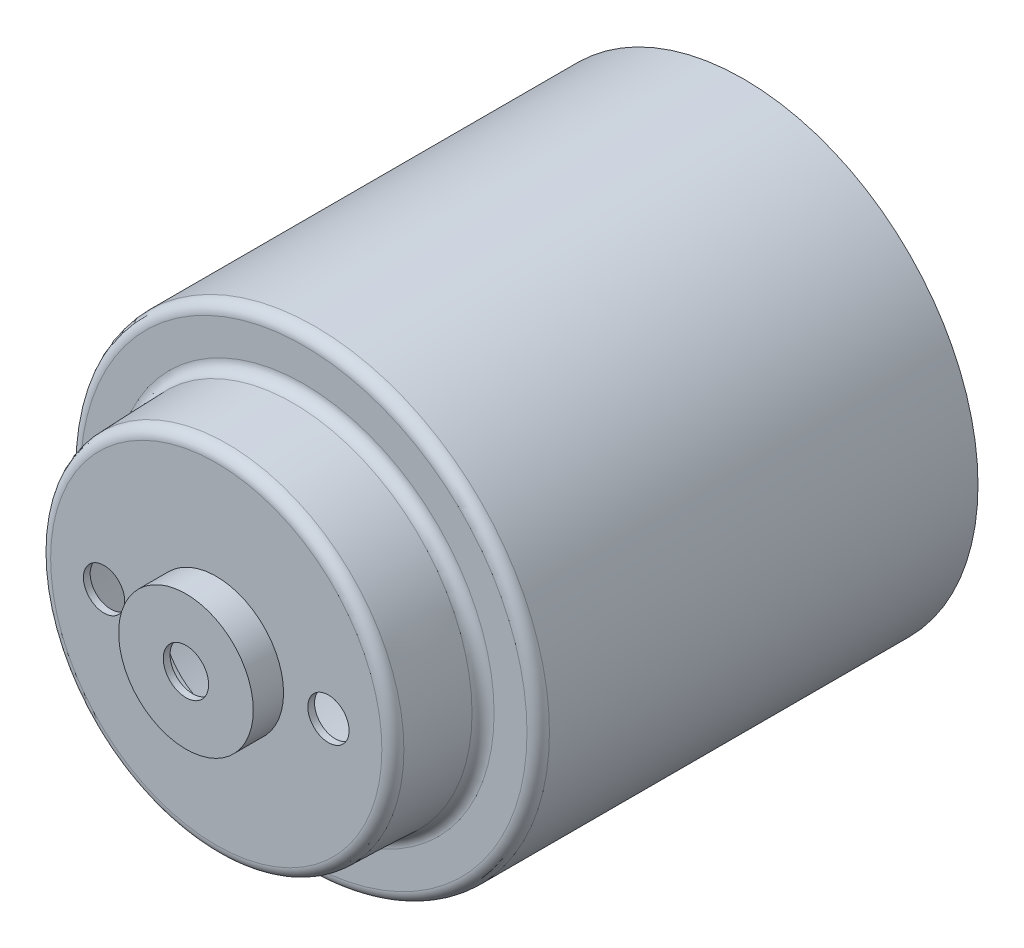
ISO-10303-21;
HEADER;
FILE_DESCRIPTION(('STEP AP214'),'2;1');
FILE_NAME('part.step','',(''),(''),'','','');
FILE_SCHEMA(('AUTOMOTIVE_DESIGN { 1 0 10303 214 1 1 1 1 }'));
ENDSEC;
DATA;
#1=APPLICATION_CONTEXT('core data for automotive mechanical design processes');
#2=APPLICATION_PROTOCOL_DEFINITION('international standard','automotive_design',2000,#1);
#3=PRODUCT_CONTEXT('',#1,'mechanical');
#4=PRODUCT('Part','Part','',(#3));
#5=PRODUCT_RELATED_PRODUCT_CATEGORY('part','',(#4));
#6=PRODUCT_DEFINITION_FORMATION('','',#4);
#7=PRODUCT_DEFINITION_CONTEXT('part definition',#1,'design');
#8=PRODUCT_DEFINITION('design','',#6,#7);
#9=PRODUCT_DEFINITION_SHAPE('','',#8);
#10=(LENGTH_UNIT() NAMED_UNIT(*) SI_UNIT(.MILLI.,.METRE.));
#11=(NAMED_UNIT(*) PLANE_ANGLE_UNIT() SI_UNIT($,.RADIAN.));
#12=(NAMED_UNIT(*) SI_UNIT($,.STERADIAN.) SOLID_ANGLE_UNIT());
#13=UNCERTAINTY_MEASURE_WITH_UNIT(LENGTH_MEASURE(1.E-05),#10,'distance_accuracy_value','');
#14=(GEOMETRIC_REPRESENTATION_CONTEXT(3) GLOBAL_UNCERTAINTY_ASSIGNED_CONTEXT((#13)) GLOBAL_UNIT_ASSIGNED_CONTEXT((#10,
#11,#12)) REPRESENTATION_CONTEXT('',''));
#15=CARTESIAN_POINT('',(0.,0.,0.));
#16=DIRECTION('',(0.,0.,1.));
#17=DIRECTION('',(1.,0.,0.));
#18=AXIS2_PLACEMENT_3D('',#15,#16,#17);
#19=CARTESIAN_POINT('',(0.,0.,23.5));
#20=DIRECTION('',(0.,0.,1.));
#21=DIRECTION('',(1.,0.,0.));
#22=AXIS2_PLACEMENT_3D('',#19,#20,#21);
#23=PLANE('',#22);
#24=CARTESIAN_POINT('',(5.00000000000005,0.,23.5));
#25=DIRECTION('',(0.,0.,1.));
#26=DIRECTION('',(1.,0.,0.));
#27=AXIS2_PLACEMENT_3D('',#24,#25,#26);
#28=CIRCLE('',#27,0.92);
#29=CARTESIAN_POINT('',(5.92000000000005,0.,23.5));
#30=VERTEX_POINT('',#29);
#31=EDGE_CURVE('E51',#30,#30,#28,.T.);
#32=ORIENTED_EDGE('',*,*,#31,.F.);
#33=EDGE_LOOP('',(#32));
#34=FACE_BOUND('',#33,.T.);
#35=CARTESIAN_POINT('',(-5.,0.,23.5));
#36=DIRECTION('',(0.,0.,1.));
#37=DIRECTION('',(1.,0.,0.));
#38=AXIS2_PLACEMENT_3D('',#35,#36,#37);
#39=CIRCLE('',#38,0.92);
#40=CARTESIAN_POINT('',(-4.08,0.,23.5));
#41=VERTEX_POINT('',#40);
#42=EDGE_CURVE('E50',#41,#41,#39,.T.);
#43=ORIENTED_EDGE('',*,*,#42,.F.);
#44=EDGE_LOOP('',(#43));
#45=FACE_BOUND('',#44,.T.);
#46=CARTESIAN_POINT('',(0.,0.,23.5));
#47=DIRECTION('',(0.,0.,1.));
#48=DIRECTION('',(1.,0.,0.));
#49=AXIS2_PLACEMENT_3D('',#46,#47,#48);
#50=CIRCLE('',#49,7.38096461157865);
#51=CARTESIAN_POINT('',(7.38096461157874,0.,23.5));
#52=VERTEX_POINT('',#51);
#53=EDGE_CURVE('E105',#52,#52,#50,.T.);
#54=ORIENTED_EDGE('',*,*,#53,.T.);
#55=EDGE_LOOP('',(#54));
#56=FACE_BOUND('',#55,.T.);
#57=CARTESIAN_POINT('',(0.,0.,23.5));
#58=DIRECTION('',(0.,0.,1.));
#59=DIRECTION('',(1.,0.,0.));
#60=AXIS2_PLACEMENT_3D('',#57,#58,#59);
#61=CIRCLE('',#60,3.);
#62=CARTESIAN_POINT('',(3.00000000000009,0.,23.5));
#63=VERTEX_POINT('',#62);
#64=EDGE_CURVE('E88',#63,#63,#61,.T.);
#65=ORIENTED_EDGE('',*,*,#64,.F.);
#66=EDGE_LOOP('',(#65));
#67=FACE_BOUND('',#66,.T.);
#68=ADVANCED_FACE('F27',(#34,#45,#56,#67),#23,.T.);
#69=CARTESIAN_POINT('',(0.,0.,19.6));
#70=DIRECTION('',(0.,0.,1.));
#71=DIRECTION('',(1.,0.,0.));
#72=AXIS2_PLACEMENT_3D('',#69,#70,#71);
#73=PLANE('',#72);
#74=CARTESIAN_POINT('',(0.,0.,19.6));
#75=DIRECTION('',(0.,0.,1.));
#76=DIRECTION('',(1.,0.,0.));
#77=AXIS2_PLACEMENT_3D('',#74,#75,#76);
#78=CIRCLE('',#77,9.95);
#79=CARTESIAN_POINT('',(9.95000000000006,0.,19.6));
#80=VERTEX_POINT('',#79);
#81=EDGE_CURVE('E35',#80,#80,#78,.T.);
#82=ORIENTED_EDGE('',*,*,#81,.T.);
#83=EDGE_LOOP('',(#82));
#84=FACE_BOUND('',#83,.T.);
#85=CARTESIAN_POINT('',(0.,0.,19.6));
#86=DIRECTION('',(0.,0.,1.));
#87=DIRECTION('',(1.,0.,0.));
#88=AXIS2_PLACEMENT_3D('',#85,#86,#87);
#89=CIRCLE('',#88,8.48284438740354);
#90=CARTESIAN_POINT('',(8.4828443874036,0.,19.6));
#91=VERTEX_POINT('',#90);
#92=EDGE_CURVE('E102',#91,#91,#89,.F.);
#93=ORIENTED_EDGE('',*,*,#92,.T.);
#94=EDGE_LOOP('',(#93));
#95=FACE_BOUND('',#94,.T.);
#96=ADVANCED_FACE('F122',(#84,#95),#73,.T.);
#97=CARTESIAN_POINT('',(0.,0.,19.6));
#98=DIRECTION('',(0.,0.,-1.));
#99=DIRECTION('',(-1.,0.,0.));
#100=AXIS2_PLACEMENT_3D('',#97,#98,#99);
#101=CYLINDRICAL_SURFACE('',#100,10.45);
#102=CARTESIAN_POINT('',(0.,0.,19.1));
#103=DIRECTION('',(0.,0.,1.));
#104=DIRECTION('',(1.,0.,0.));
#105=AXIS2_PLACEMENT_3D('',#102,#103,#104);
#106=CIRCLE('',#105,10.45);
#107=CARTESIAN_POINT('',(10.4500000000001,0.,19.1));
#108=VERTEX_POINT('',#107);
#109=EDGE_CURVE('E10',#108,#108,#106,.F.);
#110=ORIENTED_EDGE('',*,*,#109,.T.);
#111=EDGE_LOOP('',(#110));
#112=FACE_BOUND('',#111,.T.);
#113=CARTESIAN_POINT('',(0.,0.,0.));
#114=DIRECTION('',(0.,0.,1.));
#115=DIRECTION('',(1.,0.,0.));
#116=AXIS2_PLACEMENT_3D('',#113,#114,#115);
#117=CIRCLE('',#116,10.45);
#118=CARTESIAN_POINT('',(10.4500000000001,0.,0.));
#119=VERTEX_POINT('',#118);
#120=EDGE_CURVE('E96',#119,#119,#117,.T.);
#121=ORIENTED_EDGE('',*,*,#120,.T.);
#122=EDGE_LOOP('',(#121));
#123=FACE_BOUND('',#122,.T.);
#124=ADVANCED_FACE('F144',(#112,#123),#101,.T.);
#125=CARTESIAN_POINT('',(0.,0.,0.));
#126=DIRECTION('',(0.,0.,1.));
#127=DIRECTION('',(1.,0.,0.));
#128=AXIS2_PLACEMENT_3D('',#125,#126,#127);
#129=PLANE('',#128);
#130=CARTESIAN_POINT('',(0.,0.,0.));
#131=DIRECTION('',(0.,0.,1.));
#132=DIRECTION('',(1.,0.,0.));
#133=AXIS2_PLACEMENT_3D('',#130,#131,#132);
#134=CIRCLE('',#133,10.15);
#135=CARTESIAN_POINT('',(10.1500000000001,0.,0.));
#136=VERTEX_POINT('',#135);
#137=EDGE_CURVE('E74',#136,#136,#134,.T.);
#138=ORIENTED_EDGE('',*,*,#137,.T.);
#139=EDGE_LOOP('',(#138));
#140=FACE_BOUND('',#139,.T.);
#141=ORIENTED_EDGE('',*,*,#120,.F.);
#142=EDGE_LOOP('',(#141));
#143=FACE_BOUND('',#142,.T.);
#144=ADVANCED_FACE('F138',(#140,#143),#129,.F.);
#145=CARTESIAN_POINT('',(0.,0.,19.6));
#146=DIRECTION('',(0.,0.,-1.));
#147=DIRECTION('',(1.,0.,0.));
#148=AXIS2_PLACEMENT_3D('',#145,#146,#147);
#149=CONICAL_SURFACE('',#148,8.,0.0349065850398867);
#150=CARTESIAN_POINT('',(0.,0.,23.0174497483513));
#151=DIRECTION('',(0.,0.,-1.));
#152=DIRECTION('',(-1.,0.,0.));
#153=AXIS2_PLACEMENT_3D('',#150,#151,#152);
#154=CIRCLE('',#153,7.8806600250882);
#155=CARTESIAN_POINT('',(-7.88066002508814,0.,23.0174497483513));
#156=VERTEX_POINT('',#155);
#157=EDGE_CURVE('E40',#156,#156,#154,.T.);
#158=ORIENTED_EDGE('',*,*,#157,.T.);
#159=EDGE_LOOP('',(#158));
#160=FACE_BOUND('',#159,.T.);
#161=CARTESIAN_POINT('',(0.,0.,20.0825502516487));
#162=DIRECTION('',(0.,0.,1.));
#163=DIRECTION('',(1.,0.,0.));
#164=AXIS2_PLACEMENT_3D('',#161,#162,#163);
#165=CIRCLE('',#164,7.98314897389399);
#166=CARTESIAN_POINT('',(7.98314897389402,0.,20.0825502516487));
#167=VERTEX_POINT('',#166);
#168=EDGE_CURVE('E99',#167,#167,#165,.T.);
#169=ORIENTED_EDGE('',*,*,#168,.T.);
#170=EDGE_LOOP('',(#169));
#171=FACE_BOUND('',#170,.T.);
#172=ADVANCED_FACE('F29',(#160,#171),#149,.T.);
#173=CARTESIAN_POINT('',(0.,0.,24.85));
#174=DIRECTION('',(0.,0.,-1.));
#175=DIRECTION('',(-1.,0.,0.));
#176=AXIS2_PLACEMENT_3D('',#173,#174,#175);
#177=CYLINDRICAL_SURFACE('',#176,3.);
#178=CARTESIAN_POINT('',(0.,0.,24.85));
#179=DIRECTION('',(0.,0.,1.));
#180=DIRECTION('',(1.,0.,0.));
#181=AXIS2_PLACEMENT_3D('',#178,#179,#180);
#182=CIRCLE('',#181,3.);
#183=CARTESIAN_POINT('',(3.00000000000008,0.,24.85));
#184=VERTEX_POINT('',#183);
#185=EDGE_CURVE('E93',#184,#184,#182,.T.);
#186=ORIENTED_EDGE('',*,*,#185,.F.);
#187=EDGE_LOOP('',(#186));
#188=FACE_BOUND('',#187,.T.);
#189=ORIENTED_EDGE('',*,*,#64,.T.);
#190=EDGE_LOOP('',(#189));
#191=FACE_BOUND('',#190,.T.);
#192=ADVANCED_FACE('F127',(#188,#191),#177,.T.);
#193=CARTESIAN_POINT('',(0.,0.,24.85));
#194=DIRECTION('',(0.,0.,1.));
#195=DIRECTION('',(1.,0.,0.));
#196=AXIS2_PLACEMENT_3D('',#193,#194,#195);
#197=PLANE('',#196);
#198=CARTESIAN_POINT('',(0.,0.,24.85));
#199=DIRECTION('',(0.,0.,1.));
#200=DIRECTION('',(1.,0.,0.));
#201=AXIS2_PLACEMENT_3D('',#198,#199,#200);
#202=CIRCLE('',#201,1.01);
#203=CARTESIAN_POINT('',(1.01000000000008,0.,24.85));
#204=VERTEX_POINT('',#203);
#205=EDGE_CURVE('E47',#204,#204,#202,.T.);
#206=ORIENTED_EDGE('',*,*,#205,.F.);
#207=EDGE_LOOP('',(#206));
#208=FACE_BOUND('',#207,.T.);
#209=ORIENTED_EDGE('',*,*,#185,.T.);
#210=EDGE_LOOP('',(#209));
#211=FACE_BOUND('',#210,.T.);
#212=ADVANCED_FACE('F129',(#208,#211),#197,.T.);
#213=CARTESIAN_POINT('',(0.,0.,20.1));
#214=DIRECTION('',(0.,0.,1.));
#215=DIRECTION('',(1.,0.,0.));
#216=AXIS2_PLACEMENT_3D('',#213,#214,#215);
#217=TOROIDAL_SURFACE('',#216,8.48284438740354,0.5);
#218=ORIENTED_EDGE('',*,*,#92,.F.);
#219=EDGE_LOOP('',(#218));
#220=FACE_BOUND('',#219,.T.);
#221=ORIENTED_EDGE('',*,*,#168,.F.);
#222=EDGE_LOOP('',(#221));
#223=FACE_BOUND('',#222,.T.);
#224=ADVANCED_FACE('F116',(#220,#223),#217,.F.);
#225=CARTESIAN_POINT('',(0.,0.,23.));
#226=DIRECTION('',(0.,0.,1.));
#227=DIRECTION('',(1.,0.,0.));
#228=AXIS2_PLACEMENT_3D('',#225,#226,#227);
#229=TOROIDAL_SURFACE('',#228,7.38096461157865,0.5);
#230=ORIENTED_EDGE('',*,*,#157,.F.);
#231=EDGE_LOOP('',(#230));
#232=FACE_BOUND('',#231,.T.);
#233=ORIENTED_EDGE('',*,*,#53,.F.);
#234=EDGE_LOOP('',(#233));
#235=FACE_BOUND('',#234,.T.);
#236=ADVANCED_FACE('F112',(#232,#235),#229,.T.);
#237=CARTESIAN_POINT('',(0.,0.,19.1));
#238=DIRECTION('',(0.,0.,1.));
#239=DIRECTION('',(1.,0.,0.));
#240=AXIS2_PLACEMENT_3D('',#237,#238,#239);
#241=TOROIDAL_SURFACE('',#240,9.95,0.5);
#242=ORIENTED_EDGE('',*,*,#109,.F.);
#243=EDGE_LOOP('',(#242));
#244=FACE_BOUND('',#243,.T.);
#245=ORIENTED_EDGE('',*,*,#81,.F.);
#246=EDGE_LOOP('',(#245));
#247=FACE_BOUND('',#246,.T.);
#248=ADVANCED_FACE('F115',(#244,#247),#241,.T.);
#249=CARTESIAN_POINT('',(0.,0.,23.2));
#250=DIRECTION('',(0.,0.,1.));
#251=DIRECTION('',(1.,0.,0.));
#252=AXIS2_PLACEMENT_3D('',#249,#250,#251);
#253=PLANE('',#252);
#254=CARTESIAN_POINT('',(5.00000000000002,0.,23.2));
#255=DIRECTION('',(0.,0.,1.));
#256=DIRECTION('',(1.,0.,0.));
#257=AXIS2_PLACEMENT_3D('',#254,#255,#256);
#258=CIRCLE('',#257,0.92);
#259=CARTESIAN_POINT('',(5.92000000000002,0.,23.2));
#260=VERTEX_POINT('',#259);
#261=EDGE_CURVE('E31',#260,#260,#258,.T.);
#262=ORIENTED_EDGE('',*,*,#261,.T.);
#263=EDGE_LOOP('',(#262));
#264=FACE_BOUND('',#263,.T.);
#265=CARTESIAN_POINT('',(-5.,0.,23.2));
#266=DIRECTION('',(0.,0.,1.));
#267=DIRECTION('',(1.,0.,0.));
#268=AXIS2_PLACEMENT_3D('',#265,#266,#267);
#269=CIRCLE('',#268,0.92);
#270=CARTESIAN_POINT('',(-4.08,0.,23.2));
#271=VERTEX_POINT('',#270);
#272=EDGE_CURVE('E48',#271,#271,#269,.T.);
#273=ORIENTED_EDGE('',*,*,#272,.T.);
#274=EDGE_LOOP('',(#273));
#275=FACE_BOUND('',#274,.T.);
#276=CARTESIAN_POINT('',(0.,0.,23.2));
#277=DIRECTION('',(0.,0.,1.));
#278=DIRECTION('',(1.,0.,0.));
#279=AXIS2_PLACEMENT_3D('',#276,#277,#278);
#280=CIRCLE('',#279,7.38096461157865);
#281=CARTESIAN_POINT('',(7.38096461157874,0.,23.2));
#282=VERTEX_POINT('',#281);
#283=EDGE_CURVE('E64',#282,#282,#280,.T.);
#284=ORIENTED_EDGE('',*,*,#283,.F.);
#285=EDGE_LOOP('',(#284));
#286=FACE_BOUND('',#285,.T.);
#287=CARTESIAN_POINT('',(0.,0.,23.2));
#288=DIRECTION('',(0.,0.,1.));
#289=DIRECTION('',(1.,0.,0.));
#290=AXIS2_PLACEMENT_3D('',#287,#288,#289);
#291=CIRCLE('',#290,2.7);
#292=CARTESIAN_POINT('',(2.70000000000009,0.,23.2));
#293=VERTEX_POINT('',#292);
#294=EDGE_CURVE('E46',#293,#293,#291,.T.);
#295=ORIENTED_EDGE('',*,*,#294,.T.);
#296=EDGE_LOOP('',(#295));
#297=FACE_BOUND('',#296,.T.);
#298=ADVANCED_FACE('F172',(#264,#275,#286,#297),#253,.F.);
#299=CARTESIAN_POINT('',(0.,0.,19.3));
#300=DIRECTION('',(0.,0.,1.));
#301=DIRECTION('',(1.,0.,0.));
#302=AXIS2_PLACEMENT_3D('',#299,#300,#301);
#303=PLANE('',#302);
#304=CARTESIAN_POINT('',(0.,0.,19.3));
#305=DIRECTION('',(0.,0.,1.));
#306=DIRECTION('',(1.,0.,0.));
#307=AXIS2_PLACEMENT_3D('',#304,#305,#306);
#308=CIRCLE('',#307,9.95);
#309=CARTESIAN_POINT('',(9.95000000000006,0.,19.3));
#310=VERTEX_POINT('',#309);
#311=EDGE_CURVE('E77',#310,#310,#308,.T.);
#312=ORIENTED_EDGE('',*,*,#311,.F.);
#313=EDGE_LOOP('',(#312));
#314=FACE_BOUND('',#313,.T.);
#315=CARTESIAN_POINT('',(0.,0.,19.3));
#316=DIRECTION('',(0.,0.,1.));
#317=DIRECTION('',(1.,0.,0.));
#318=AXIS2_PLACEMENT_3D('',#315,#316,#317);
#319=CIRCLE('',#318,8.48284438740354);
#320=CARTESIAN_POINT('',(8.4828443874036,0.,19.3));
#321=VERTEX_POINT('',#320);
#322=EDGE_CURVE('E68',#321,#321,#319,.F.);
#323=ORIENTED_EDGE('',*,*,#322,.F.);
#324=EDGE_LOOP('',(#323));
#325=FACE_BOUND('',#324,.T.);
#326=ADVANCED_FACE('F177',(#314,#325),#303,.F.);
#327=CARTESIAN_POINT('',(0.,0.,19.6));
#328=DIRECTION('',(0.,0.,-1.));
#329=DIRECTION('',(-1.,0.,0.));
#330=AXIS2_PLACEMENT_3D('',#327,#328,#329);
#331=CYLINDRICAL_SURFACE('',#330,10.15);
#332=CARTESIAN_POINT('',(0.,0.,19.1));
#333=DIRECTION('',(0.,0.,-1.));
#334=DIRECTION('',(-1.,0.,0.));
#335=AXIS2_PLACEMENT_3D('',#332,#333,#334);
#336=CIRCLE('',#335,10.15);
#337=CARTESIAN_POINT('',(-10.15,0.,19.1));
#338=VERTEX_POINT('',#337);
#339=EDGE_CURVE('E85',#338,#338,#336,.T.);
#340=ORIENTED_EDGE('',*,*,#339,.F.);
#341=EDGE_LOOP('',(#340));
#342=FACE_BOUND('',#341,.T.);
#343=ORIENTED_EDGE('',*,*,#137,.F.);
#344=EDGE_LOOP('',(#343));
#345=FACE_BOUND('',#344,.T.);
#346=ADVANCED_FACE('F185',(#342,#345),#331,.F.);
#347=CARTESIAN_POINT('',(0.,0.,19.5895301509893));
#348=DIRECTION('',(0.,0.,-1.));
#349=DIRECTION('',(1.,0.,0.));
#350=AXIS2_PLACEMENT_3D('',#347,#348,#349);
#351=CONICAL_SURFACE('',#350,7.70018275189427,0.0349065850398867);
#352=CARTESIAN_POINT('',(0.,0.,23.0069798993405));
#353=DIRECTION('',(0.,0.,-1.));
#354=DIRECTION('',(-1.,0.,0.));
#355=AXIS2_PLACEMENT_3D('',#352,#353,#354);
#356=CIRCLE('',#355,7.58084277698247);
#357=CARTESIAN_POINT('',(-7.58084277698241,0.,23.0069798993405));
#358=VERTEX_POINT('',#357);
#359=EDGE_CURVE('E67',#358,#358,#356,.T.);
#360=ORIENTED_EDGE('',*,*,#359,.F.);
#361=EDGE_LOOP('',(#360));
#362=FACE_BOUND('',#361,.T.);
#363=CARTESIAN_POINT('',(0.,0.,20.072080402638));
#364=DIRECTION('',(0.,0.,-1.));
#365=DIRECTION('',(-1.,0.,0.));
#366=AXIS2_PLACEMENT_3D('',#363,#364,#365);
#367=CIRCLE('',#366,7.68333172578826);
#368=CARTESIAN_POINT('',(-7.68333172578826,0.,20.072080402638));
#369=VERTEX_POINT('',#368);
#370=EDGE_CURVE('E78',#369,#369,#367,.F.);
#371=ORIENTED_EDGE('',*,*,#370,.F.);
#372=EDGE_LOOP('',(#371));
#373=FACE_BOUND('',#372,.T.);
#374=ADVANCED_FACE('F193',(#362,#373),#351,.F.);
#375=CARTESIAN_POINT('',(0.,0.,24.85));
#376=DIRECTION('',(0.,0.,-1.));
#377=DIRECTION('',(-1.,0.,0.));
#378=AXIS2_PLACEMENT_3D('',#375,#376,#377);
#379=CYLINDRICAL_SURFACE('',#378,2.7);
#380=CARTESIAN_POINT('',(0.,0.,24.55));
#381=DIRECTION('',(0.,0.,1.));
#382=DIRECTION('',(1.,0.,0.));
#383=AXIS2_PLACEMENT_3D('',#380,#381,#382);
#384=CIRCLE('',#383,2.7);
#385=CARTESIAN_POINT('',(2.70000000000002,0.,24.55));
#386=VERTEX_POINT('',#385);
#387=EDGE_CURVE('E71',#386,#386,#384,.T.);
#388=ORIENTED_EDGE('',*,*,#387,.T.);
#389=EDGE_LOOP('',(#388));
#390=FACE_BOUND('',#389,.T.);
#391=ORIENTED_EDGE('',*,*,#294,.F.);
#392=EDGE_LOOP('',(#391));
#393=FACE_BOUND('',#392,.T.);
#394=ADVANCED_FACE('F201',(#390,#393),#379,.F.);
#395=CARTESIAN_POINT('',(0.,0.,24.55));
#396=DIRECTION('',(0.,0.,1.));
#397=DIRECTION('',(1.,0.,0.));
#398=AXIS2_PLACEMENT_3D('',#395,#396,#397);
#399=PLANE('',#398);
#400=CARTESIAN_POINT('',(0.,0.,24.55));
#401=DIRECTION('',(0.,0.,1.));
#402=DIRECTION('',(1.,0.,0.));
#403=AXIS2_PLACEMENT_3D('',#400,#401,#402);
#404=CIRCLE('',#403,1.01);
#405=CARTESIAN_POINT('',(1.01000000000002,0.,24.55));
#406=VERTEX_POINT('',#405);
#407=EDGE_CURVE('E44',#406,#406,#404,.T.);
#408=ORIENTED_EDGE('',*,*,#407,.T.);
#409=EDGE_LOOP('',(#408));
#410=FACE_BOUND('',#409,.T.);
#411=ORIENTED_EDGE('',*,*,#387,.F.);
#412=EDGE_LOOP('',(#411));
#413=FACE_BOUND('',#412,.T.);
#414=ADVANCED_FACE('F209',(#410,#413),#399,.F.);
#415=CARTESIAN_POINT('',(0.,0.,20.1));
#416=DIRECTION('',(0.,0.,1.));
#417=DIRECTION('',(1.,0.,0.));
#418=AXIS2_PLACEMENT_3D('',#415,#416,#417);
#419=TOROIDAL_SURFACE('',#418,8.48284438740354,0.8);
#420=ORIENTED_EDGE('',*,*,#322,.T.);
#421=EDGE_LOOP('',(#420));
#422=FACE_BOUND('',#421,.T.);
#423=ORIENTED_EDGE('',*,*,#370,.T.);
#424=EDGE_LOOP('',(#423));
#425=FACE_BOUND('',#424,.T.);
#426=ADVANCED_FACE('F217',(#422,#425),#419,.T.);
#427=CARTESIAN_POINT('',(0.,0.,23.));
#428=DIRECTION('',(0.,0.,1.));
#429=DIRECTION('',(1.,0.,0.));
#430=AXIS2_PLACEMENT_3D('',#427,#428,#429);
#431=TOROIDAL_SURFACE('',#430,7.38096461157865,0.2);
#432=ORIENTED_EDGE('',*,*,#359,.T.);
#433=EDGE_LOOP('',(#432));
#434=FACE_BOUND('',#433,.T.);
#435=ORIENTED_EDGE('',*,*,#283,.T.);
#436=EDGE_LOOP('',(#435));
#437=FACE_BOUND('',#436,.T.);
#438=ADVANCED_FACE('F225',(#434,#437),#431,.F.);
#439=CARTESIAN_POINT('',(0.,0.,19.1));
#440=DIRECTION('',(0.,0.,1.));
#441=DIRECTION('',(1.,0.,0.));
#442=AXIS2_PLACEMENT_3D('',#439,#440,#441);
#443=TOROIDAL_SURFACE('',#442,9.95,0.2);
#444=ORIENTED_EDGE('',*,*,#339,.T.);
#445=EDGE_LOOP('',(#444));
#446=FACE_BOUND('',#445,.T.);
#447=ORIENTED_EDGE('',*,*,#311,.T.);
#448=EDGE_LOOP('',(#447));
#449=FACE_BOUND('',#448,.T.);
#450=ADVANCED_FACE('F233',(#446,#449),#443,.F.);
#451=CARTESIAN_POINT('',(0.,0.,0.));
#452=DIRECTION('',(0.,0.,1.));
#453=DIRECTION('',(1.,0.,0.));
#454=AXIS2_PLACEMENT_3D('',#451,#452,#453);
#455=CYLINDRICAL_SURFACE('',#454,1.01);
#456=ORIENTED_EDGE('',*,*,#205,.T.);
#457=EDGE_LOOP('',(#456));
#458=FACE_BOUND('',#457,.T.);
#459=ORIENTED_EDGE('',*,*,#407,.F.);
#460=EDGE_LOOP('',(#459));
#461=FACE_BOUND('',#460,.T.);
#462=ADVANCED_FACE('F241',(#458,#461),#455,.F.);
#463=CARTESIAN_POINT('',(-4.99999999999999,0.,0.));
#464=DIRECTION('',(0.,0.,1.));
#465=DIRECTION('',(1.,0.,0.));
#466=AXIS2_PLACEMENT_3D('',#463,#464,#465);
#467=CYLINDRICAL_SURFACE('',#466,0.92);
#468=ORIENTED_EDGE('',*,*,#42,.T.);
#469=EDGE_LOOP('',(#468));
#470=FACE_BOUND('',#469,.T.);
#471=ORIENTED_EDGE('',*,*,#272,.F.);
#472=EDGE_LOOP('',(#471));
#473=FACE_BOUND('',#472,.T.);
#474=ADVANCED_FACE('F249',(#470,#473),#467,.F.);
#475=CARTESIAN_POINT('',(5.00000000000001,0.,0.));
#476=DIRECTION('',(0.,0.,1.));
#477=DIRECTION('',(1.,0.,0.));
#478=AXIS2_PLACEMENT_3D('',#475,#476,#477);
#479=CYLINDRICAL_SURFACE('',#478,0.92);
#480=ORIENTED_EDGE('',*,*,#31,.T.);
#481=EDGE_LOOP('',(#480));
#482=FACE_BOUND('',#481,.T.);
#483=ORIENTED_EDGE('',*,*,#261,.F.);
#484=EDGE_LOOP('',(#483));
#485=FACE_BOUND('',#484,.T.);
#486=ADVANCED_FACE('F257',(#482,#485),#479,.F.);
#487=CLOSED_SHELL('',(#68,#96,#124,#144,#172,#192,#212,#224,#236,#248,#298,#326,#346,#374,#394,
#414,#426,#438,#450,#462,#474,#486));
#488=MANIFOLD_SOLID_BREP('B2',#487);
#489=ADVANCED_BREP_SHAPE_REPRESENTATION('',(#18,#488),#14);
#490=SHAPE_DEFINITION_REPRESENTATION(#9,#489);
ENDSEC;
END-ISO-10303-21;
